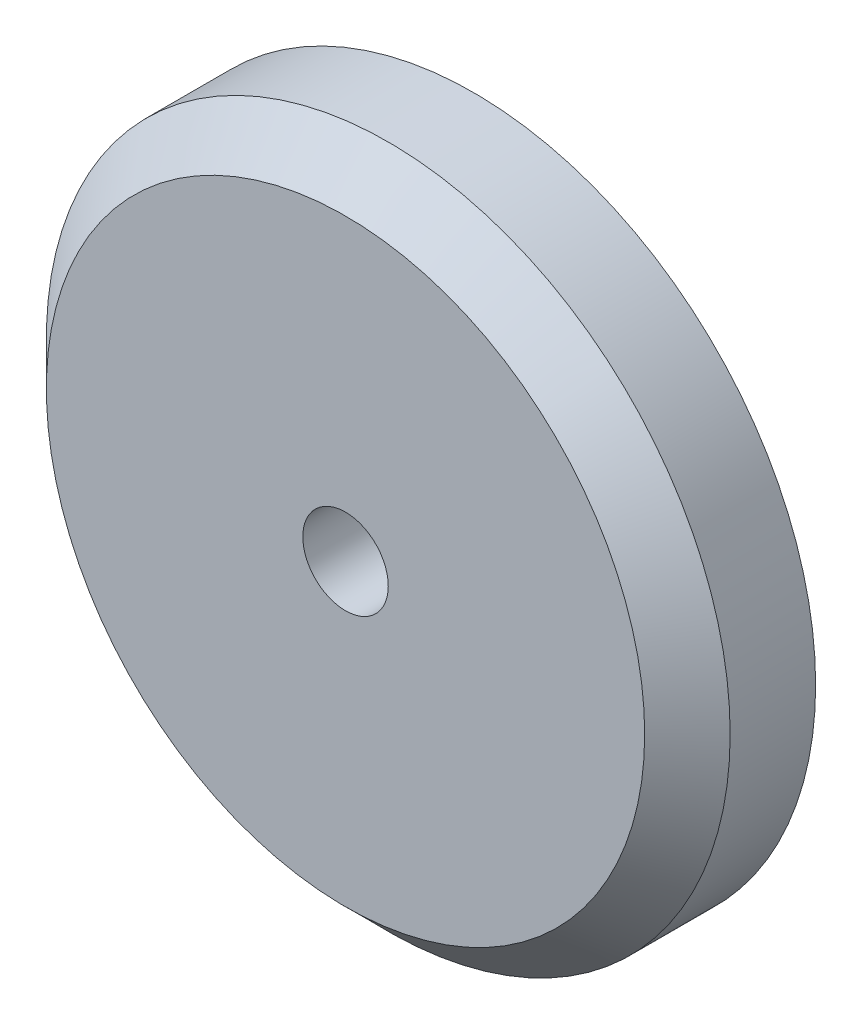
ISO-10303-21;
HEADER;
FILE_DESCRIPTION(('STEP AP214'),'2;1');
FILE_NAME('part.step','',(''),(''),'','','');
FILE_SCHEMA(('AUTOMOTIVE_DESIGN { 1 0 10303 214 1 1 1 1 }'));
ENDSEC;
DATA;
#1=APPLICATION_CONTEXT('core data for automotive mechanical design processes');
#2=APPLICATION_PROTOCOL_DEFINITION('international standard','automotive_design',2000,#1);
#3=PRODUCT_CONTEXT('',#1,'mechanical');
#4=PRODUCT('Part','Part','',(#3));
#5=PRODUCT_RELATED_PRODUCT_CATEGORY('part','',(#4));
#6=PRODUCT_DEFINITION_FORMATION('','',#4);
#7=PRODUCT_DEFINITION_CONTEXT('part definition',#1,'design');
#8=PRODUCT_DEFINITION('design','',#6,#7);
#9=PRODUCT_DEFINITION_SHAPE('','',#8);
#10=(LENGTH_UNIT() NAMED_UNIT(*) SI_UNIT(.MILLI.,.METRE.));
#11=(NAMED_UNIT(*) PLANE_ANGLE_UNIT() SI_UNIT($,.RADIAN.));
#12=(NAMED_UNIT(*) SI_UNIT($,.STERADIAN.) SOLID_ANGLE_UNIT());
#13=UNCERTAINTY_MEASURE_WITH_UNIT(LENGTH_MEASURE(1.E-05),#10,'distance_accuracy_value','');
#14=(GEOMETRIC_REPRESENTATION_CONTEXT(3) GLOBAL_UNCERTAINTY_ASSIGNED_CONTEXT((#13)) GLOBAL_UNIT_ASSIGNED_CONTEXT((#10,
#11,#12)) REPRESENTATION_CONTEXT('',''));
#15=CARTESIAN_POINT('',(0.,0.,0.));
#16=DIRECTION('',(0.,0.,1.));
#17=DIRECTION('',(1.,0.,0.));
#18=AXIS2_PLACEMENT_3D('',#15,#16,#17);
#19=CARTESIAN_POINT('',(0.,0.,15.));
#20=DIRECTION('',(0.,0.,1.));
#21=DIRECTION('',(1.,0.,0.));
#22=AXIS2_PLACEMENT_3D('',#19,#20,#21);
#23=PLANE('',#22);
#24=CARTESIAN_POINT('',(0.,0.,15.));
#25=DIRECTION('',(0.,0.,1.));
#26=DIRECTION('',(1.,0.,0.));
#27=AXIS2_PLACEMENT_3D('',#24,#25,#26);
#28=CIRCLE('',#27,35.);
#29=CARTESIAN_POINT('',(35.,0.,15.));
#30=VERTEX_POINT('',#29);
#31=EDGE_CURVE('E50',#30,#30,#28,.T.);
#32=ORIENTED_EDGE('',*,*,#31,.T.);
#33=EDGE_LOOP('',(#32));
#34=FACE_BOUND('',#33,.T.);
#35=CARTESIAN_POINT('',(0.,0.,15.));
#36=DIRECTION('',(0.,0.,1.));
#37=DIRECTION('',(1.,0.,0.));
#38=AXIS2_PLACEMENT_3D('',#35,#36,#37);
#39=CIRCLE('',#38,5.);
#40=CARTESIAN_POINT('',(5.,0.,15.));
#41=VERTEX_POINT('',#40);
#42=EDGE_CURVE('E58',#41,#41,#39,.T.);
#43=ORIENTED_EDGE('',*,*,#42,.F.);
#44=EDGE_LOOP('',(#43));
#45=FACE_BOUND('',#44,.T.);
#46=ADVANCED_FACE('F43',(#34,#45),#23,.T.);
#47=CARTESIAN_POINT('',(0.,0.,0.));
#48=DIRECTION('',(0.,0.,1.));
#49=DIRECTION('',(1.,0.,0.));
#50=AXIS2_PLACEMENT_3D('',#47,#48,#49);
#51=PLANE('',#50);
#52=CARTESIAN_POINT('',(0.,0.,0.));
#53=DIRECTION('',(0.,0.,1.));
#54=DIRECTION('',(1.,0.,0.));
#55=AXIS2_PLACEMENT_3D('',#52,#53,#54);
#56=CIRCLE('',#55,40.);
#57=CARTESIAN_POINT('',(40.,0.,0.));
#58=VERTEX_POINT('',#57);
#59=EDGE_CURVE('E54',#58,#58,#56,.T.);
#60=ORIENTED_EDGE('',*,*,#59,.F.);
#61=EDGE_LOOP('',(#60));
#62=FACE_BOUND('',#61,.T.);
#63=CARTESIAN_POINT('',(0.,0.,0.));
#64=DIRECTION('',(0.,0.,1.));
#65=DIRECTION('',(1.,0.,0.));
#66=AXIS2_PLACEMENT_3D('',#63,#64,#65);
#67=CIRCLE('',#66,5.);
#68=CARTESIAN_POINT('',(5.,0.,0.));
#69=VERTEX_POINT('',#68);
#70=EDGE_CURVE('E61',#69,#69,#67,.T.);
#71=ORIENTED_EDGE('',*,*,#70,.T.);
#72=EDGE_LOOP('',(#71));
#73=FACE_BOUND('',#72,.T.);
#74=ADVANCED_FACE('F71',(#62,#73),#51,.F.);
#75=CARTESIAN_POINT('',(0.,0.,15.));
#76=DIRECTION('',(0.,0.,-1.));
#77=DIRECTION('',(-1.,0.,0.));
#78=AXIS2_PLACEMENT_3D('',#75,#76,#77);
#79=CYLINDRICAL_SURFACE('',#78,40.);
#80=CARTESIAN_POINT('',(0.,0.,9.99999999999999));
#81=DIRECTION('',(0.,0.,1.));
#82=DIRECTION('',(1.,0.,0.));
#83=AXIS2_PLACEMENT_3D('',#80,#81,#82);
#84=CIRCLE('',#83,40.);
#85=CARTESIAN_POINT('',(40.,0.,9.99999999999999));
#86=VERTEX_POINT('',#85);
#87=EDGE_CURVE('E12',#86,#86,#84,.F.);
#88=ORIENTED_EDGE('',*,*,#87,.T.);
#89=EDGE_LOOP('',(#88));
#90=FACE_BOUND('',#89,.T.);
#91=ORIENTED_EDGE('',*,*,#59,.T.);
#92=EDGE_LOOP('',(#91));
#93=FACE_BOUND('',#92,.T.);
#94=ADVANCED_FACE('F76',(#90,#93),#79,.T.);
#95=CARTESIAN_POINT('',(0.,0.,15.));
#96=DIRECTION('',(0.,0.,-1.));
#97=DIRECTION('',(-1.,0.,0.));
#98=AXIS2_PLACEMENT_3D('',#95,#96,#97);
#99=CYLINDRICAL_SURFACE('',#98,5.);
#100=ORIENTED_EDGE('',*,*,#42,.T.);
#101=EDGE_LOOP('',(#100));
#102=FACE_BOUND('',#101,.T.);
#103=ORIENTED_EDGE('',*,*,#70,.F.);
#104=EDGE_LOOP('',(#103));
#105=FACE_BOUND('',#104,.T.);
#106=ADVANCED_FACE('F67',(#102,#105),#99,.F.);
#107=CARTESIAN_POINT('',(0.,0.,15.));
#108=DIRECTION('',(0.,0.,-1.));
#109=DIRECTION('',(-1.,0.,0.));
#110=AXIS2_PLACEMENT_3D('',#107,#108,#109);
#111=CONICAL_SURFACE('',#110,35.,0.785398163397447);
#112=ORIENTED_EDGE('',*,*,#87,.F.);
#113=EDGE_LOOP('',(#112));
#114=FACE_BOUND('',#113,.T.);
#115=ORIENTED_EDGE('',*,*,#31,.F.);
#116=EDGE_LOOP('',(#115));
#117=FACE_BOUND('',#116,.T.);
#118=ADVANCED_FACE('F45',(#114,#117),#111,.T.);
#119=CLOSED_SHELL('',(#46,#74,#94,#106,#118));
#120=MANIFOLD_SOLID_BREP('B2',#119);
#121=ADVANCED_BREP_SHAPE_REPRESENTATION('',(#18,#120),#14);
#122=SHAPE_DEFINITION_REPRESENTATION(#9,#121);
ENDSEC;
END-ISO-10303-21;
